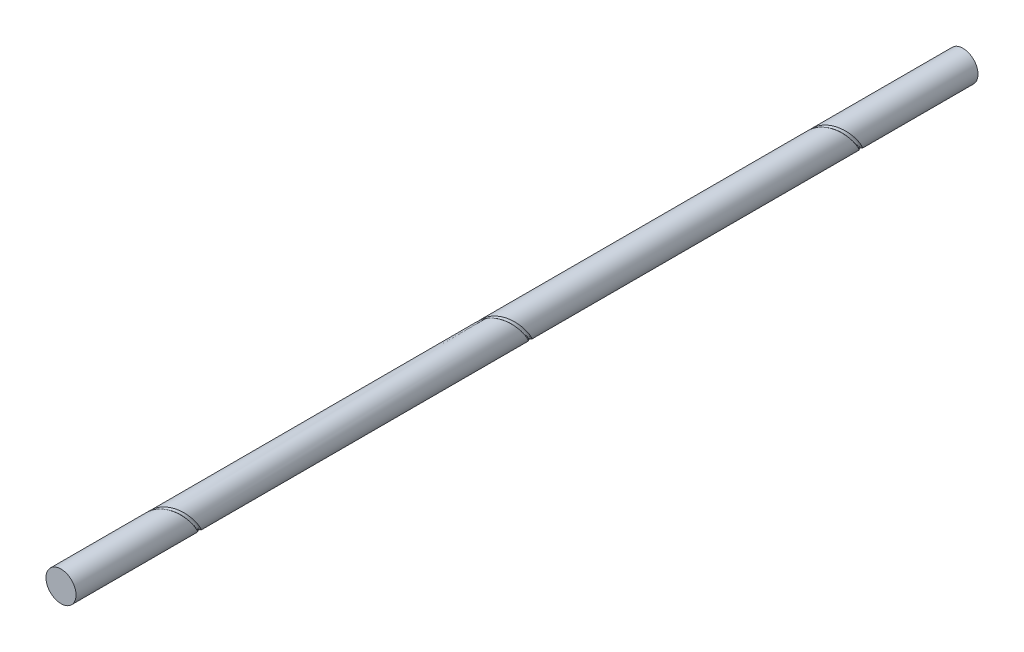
from build123d import *

# Parameters (mm, degrees)
SKETCH1_R              = 25
BOSS_EXTRUDE1_DEPTH    = 1500
CUT_SWEEP1_PITCH       = 100
CUT_SWEEP1_HEIGHT      = 100
CUT_SWEEP1_RADIUS      = 27.646
CUT_SWEEP1_START_ANGLE = -180
SKETCH3_R              = 3.969
LPATTERN1_COUNT        = 3
LPATTERN1_PITCH        = 550


with BuildPart() as part:
    # Sketch1 → Boss-Extrude1 (new body)
    with BuildSketch(Plane.XY):
        Circle(SKETCH1_R)
    extrude(amount=BOSS_EXTRUDE1_DEPTH)

    # Cut-Sweep1: sweep along a helix
    with BuildLine() as cut_sweep1_path:
        add(Helix(CUT_SWEEP1_PITCH, CUT_SWEEP1_HEIGHT, CUT_SWEEP1_RADIUS, center=(0, 0, 150), direction=(0, 0, 1), mode=Mode.PRIVATE).rotate(Axis((0, 0, 150), (0, 0, 1)), CUT_SWEEP1_START_ANGLE))
    # Sketch3 → Cut-Sweep1 (sweep, cut)
    with BuildSketch(Plane(origin=(0, 0, 0), x_dir=(1, 0, 0), z_dir=(0, 1, 0))):
        with Locations((-27.646, -150)):
            Circle(SKETCH3_R)
    cut_sweep1 = sweep(path=cut_sweep1_path.line, is_frenet=True, mode=Mode.SUBTRACT)

    # LPattern1: Cut-Sweep1 ×3
    with Locations(*[(0, 0, i * LPATTERN1_PITCH) for i in range(1, LPATTERN1_COUNT)]):
        add(cut_sweep1, mode=Mode.SUBTRACT)


solid = part.part
